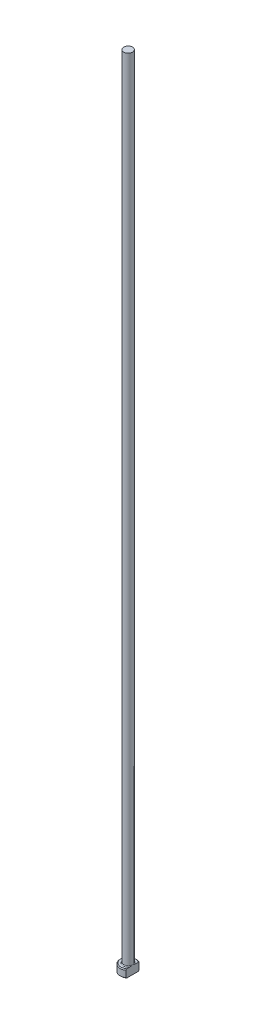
ISO-10303-21;
HEADER;
FILE_DESCRIPTION(('STEP AP214'),'2;1');
FILE_NAME('part.step','',(''),(''),'','','');
FILE_SCHEMA(('AUTOMOTIVE_DESIGN { 1 0 10303 214 1 1 1 1 }'));
ENDSEC;
DATA;
#1=APPLICATION_CONTEXT('core data for automotive mechanical design processes');
#2=APPLICATION_PROTOCOL_DEFINITION('international standard','automotive_design',2000,#1);
#3=PRODUCT_CONTEXT('',#1,'mechanical');
#4=PRODUCT('Part','Part','',(#3));
#5=PRODUCT_RELATED_PRODUCT_CATEGORY('part','',(#4));
#6=PRODUCT_DEFINITION_FORMATION('','',#4);
#7=PRODUCT_DEFINITION_CONTEXT('part definition',#1,'design');
#8=PRODUCT_DEFINITION('design','',#6,#7);
#9=PRODUCT_DEFINITION_SHAPE('','',#8);
#10=(LENGTH_UNIT() NAMED_UNIT(*) SI_UNIT(.MILLI.,.METRE.));
#11=(NAMED_UNIT(*) PLANE_ANGLE_UNIT() SI_UNIT($,.RADIAN.));
#12=(NAMED_UNIT(*) SI_UNIT($,.STERADIAN.) SOLID_ANGLE_UNIT());
#13=UNCERTAINTY_MEASURE_WITH_UNIT(LENGTH_MEASURE(1.E-05),#10,'distance_accuracy_value','');
#14=(GEOMETRIC_REPRESENTATION_CONTEXT(3) GLOBAL_UNCERTAINTY_ASSIGNED_CONTEXT((#13)) GLOBAL_UNIT_ASSIGNED_CONTEXT((#10,
#11,#12)) REPRESENTATION_CONTEXT('',''));
#15=CARTESIAN_POINT('',(0.,0.,0.));
#16=DIRECTION('',(0.,0.,1.));
#17=DIRECTION('',(1.,0.,0.));
#18=AXIS2_PLACEMENT_3D('',#15,#16,#17);
#19=CARTESIAN_POINT('',(0.,0.,0.));
#20=DIRECTION('',(0.,-1.,0.));
#21=DIRECTION('',(0.,0.,-1.));
#22=AXIS2_PLACEMENT_3D('',#19,#20,#21);
#23=PLANE('',#22);
#24=CARTESIAN_POINT('',(0.,0.,0.));
#25=DIRECTION('',(0.,-1.,0.));
#26=DIRECTION('',(0.,0.,-1.));
#27=AXIS2_PLACEMENT_3D('',#24,#25,#26);
#28=CIRCLE('',#27,1.8);
#29=CARTESIAN_POINT('',(1.09999999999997,0.,1.42478068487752));
#30=VERTEX_POINT('',#29);
#31=CARTESIAN_POINT('',(1.09999999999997,0.,-1.42478068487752));
#32=VERTEX_POINT('',#31);
#33=EDGE_CURVE('E98',#30,#32,#28,.T.);
#34=ORIENTED_EDGE('',*,*,#33,.T.);
#35=DIRECTION('',(0.,0.,1.));
#36=VECTOR('',#35,1.);
#37=CARTESIAN_POINT('',(1.09999999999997,0.,-1.67032930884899));
#38=LINE('',#37,#36);
#39=EDGE_CURVE('E83',#32,#30,#38,.T.);
#40=ORIENTED_EDGE('',*,*,#39,.T.);
#41=EDGE_LOOP('',(#34,#40));
#42=FACE_BOUND('',#41,.T.);
#43=ADVANCED_FACE('F32',(#42),#23,.T.);
#44=CARTESIAN_POINT('',(0.,259.958771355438,0.));
#45=DIRECTION('',(0.,1.,0.));
#46=DIRECTION('',(0.,0.,1.));
#47=AXIS2_PLACEMENT_3D('',#44,#45,#46);
#48=CYLINDRICAL_SURFACE('',#47,1.99999999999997);
#49=CARTESIAN_POINT('',(0.,1.80000000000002,0.));
#50=DIRECTION('',(0.,1.,0.));
#51=DIRECTION('',(0.,0.,1.));
#52=AXIS2_PLACEMENT_3D('',#49,#50,#51);
#53=CIRCLE('',#52,1.99999999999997);
#54=CARTESIAN_POINT('',(1.09999999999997,1.80000000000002,1.67032930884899));
#55=VERTEX_POINT('',#54);
#56=CARTESIAN_POINT('',(1.09999999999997,1.80000000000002,-1.67032930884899));
#57=VERTEX_POINT('',#56);
#58=EDGE_CURVE('E104',#55,#57,#53,.F.);
#59=ORIENTED_EDGE('',*,*,#58,.T.);
#60=DIRECTION('',(0.,-1.,0.));
#61=VECTOR('',#60,1.);
#62=CARTESIAN_POINT('',(1.09999999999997,200.,-1.67032930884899));
#63=LINE('',#62,#61);
#64=CARTESIAN_POINT('',(1.09999999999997,0.199999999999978,-1.67032930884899));
#65=VERTEX_POINT('',#64);
#66=EDGE_CURVE('E183',#57,#65,#63,.T.);
#67=ORIENTED_EDGE('',*,*,#66,.T.);
#68=CARTESIAN_POINT('',(0.,0.199999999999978,0.));
#69=DIRECTION('',(0.,-1.,0.));
#70=DIRECTION('',(0.,0.,-1.));
#71=AXIS2_PLACEMENT_3D('',#68,#69,#70);
#72=CIRCLE('',#71,1.99999999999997);
#73=CARTESIAN_POINT('',(1.09999999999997,0.199999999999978,1.67032930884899));
#74=VERTEX_POINT('',#73);
#75=EDGE_CURVE('E100',#65,#74,#72,.F.);
#76=ORIENTED_EDGE('',*,*,#75,.T.);
#77=DIRECTION('',(0.,-1.,0.));
#78=VECTOR('',#77,1.);
#79=CARTESIAN_POINT('',(1.09999999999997,200.,1.67032930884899));
#80=LINE('',#79,#78);
#81=EDGE_CURVE('E93',#55,#74,#80,.T.);
#82=ORIENTED_EDGE('',*,*,#81,.F.);
#83=EDGE_LOOP('',(#59,#67,#76,#82));
#84=FACE_BOUND('',#83,.T.);
#85=ADVANCED_FACE('F158',(#84),#48,.T.);
#86=CARTESIAN_POINT('',(-1.99999999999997,2.,0.));
#87=DIRECTION('',(0.,1.,0.));
#88=DIRECTION('',(0.,0.,1.));
#89=AXIS2_PLACEMENT_3D('',#86,#87,#88);
#90=PLANE('',#89);
#91=CARTESIAN_POINT('',(0.,2.,0.));
#92=DIRECTION('',(0.,1.,0.));
#93=DIRECTION('',(0.,0.,1.));
#94=AXIS2_PLACEMENT_3D('',#91,#92,#93);
#95=CIRCLE('',#94,1.8);
#96=CARTESIAN_POINT('',(1.09999999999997,2.,-1.42478068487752));
#97=VERTEX_POINT('',#96);
#98=CARTESIAN_POINT('',(1.09999999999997,2.,1.42478068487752));
#99=VERTEX_POINT('',#98);
#100=EDGE_CURVE('E178',#97,#99,#95,.T.);
#101=ORIENTED_EDGE('',*,*,#100,.T.);
#102=DIRECTION('',(0.,0.,-1.));
#103=VECTOR('',#102,1.);
#104=CARTESIAN_POINT('',(1.09999999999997,2.,0.));
#105=LINE('',#104,#103);
#106=CARTESIAN_POINT('',(1.09999999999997,1.99999999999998,0.692820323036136));
#107=VERTEX_POINT('',#106);
#108=EDGE_CURVE('E57',#99,#107,#105,.T.);
#109=ORIENTED_EDGE('',*,*,#108,.T.);
#110=CARTESIAN_POINT('',(0.,2.,0.));
#111=DIRECTION('',(0.,1.,0.));
#112=DIRECTION('',(0.,0.,1.));
#113=AXIS2_PLACEMENT_3D('',#110,#111,#112);
#114=CIRCLE('',#113,1.29999999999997);
#115=CARTESIAN_POINT('',(1.09999999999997,1.99999999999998,-0.692820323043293));
#116=VERTEX_POINT('',#115);
#117=EDGE_CURVE('E107',#107,#116,#114,.F.);
#118=ORIENTED_EDGE('',*,*,#117,.T.);
#119=EDGE_CURVE('E136',#116,#97,#105,.T.);
#120=ORIENTED_EDGE('',*,*,#119,.T.);
#121=EDGE_LOOP('',(#101,#109,#118,#120));
#122=FACE_BOUND('',#121,.T.);
#123=ADVANCED_FACE('F147',(#122),#90,.T.);
#124=CARTESIAN_POINT('',(0.,2.,0.));
#125=DIRECTION('',(0.,-1.,0.));
#126=DIRECTION('',(0.,0.,-1.));
#127=AXIS2_PLACEMENT_3D('',#124,#125,#126);
#128=CONICAL_SURFACE('',#127,1.8,0.785398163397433);
#129=ORIENTED_EDGE('',*,*,#58,.F.);
#130=CARTESIAN_POINT('',(1.09999999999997,-0.0394609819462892,3.67851337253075));
#131=CARTESIAN_POINT('',(1.09999999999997,0.0938871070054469,3.53927086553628));
#132=CARTESIAN_POINT('',(1.09999999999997,0.226969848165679,3.39976850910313));
#133=CARTESIAN_POINT('',(1.09999999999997,0.492235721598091,3.11984283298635));
#134=CARTESIAN_POINT('',(1.09999999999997,0.624418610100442,2.97941928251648));
#135=CARTESIAN_POINT('',(1.09999999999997,0.887405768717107,2.69736523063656));
#136=CARTESIAN_POINT('',(1.09999999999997,1.01821044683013,2.55573511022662));
#137=CARTESIAN_POINT('',(1.09999999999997,1.27771059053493,2.27057337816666));
#138=CARTESIAN_POINT('',(1.09999999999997,1.4064063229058,2.12704201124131));
#139=CARTESIAN_POINT('',(1.09999999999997,1.59274008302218,1.91391242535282));
#140=CARTESIAN_POINT('',(1.09999999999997,1.65179690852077,1.84555665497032));
#141=CARTESIAN_POINT('',(1.09999999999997,1.76883123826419,1.7079133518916));
#142=CARTESIAN_POINT('',(1.09999999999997,1.82680864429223,1.63862573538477));
#143=CARTESIAN_POINT('',(1.09999999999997,1.9413908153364,1.49868129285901));
#144=CARTESIAN_POINT('',(1.09999999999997,1.99799249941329,1.42802193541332));
#145=CARTESIAN_POINT('',(1.09999999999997,2.10905321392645,1.28504453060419));
#146=CARTESIAN_POINT('',(1.09999999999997,2.16351265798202,1.21272680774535));
#147=CARTESIAN_POINT('',(1.09999999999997,2.25351962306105,1.08760351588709));
#148=CARTESIAN_POINT('',(1.09999999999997,2.28987864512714,1.03538457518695));
#149=CARTESIAN_POINT('',(1.09999999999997,2.3604146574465,0.929499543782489));
#150=CARTESIAN_POINT('',(1.09999999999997,2.39459216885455,0.875833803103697));
#151=CARTESIAN_POINT('',(1.09999999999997,2.45984644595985,0.766757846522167));
#152=CARTESIAN_POINT('',(1.09999999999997,2.4909289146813,0.711351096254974));
#153=CARTESIAN_POINT('',(1.09999999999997,2.54873716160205,0.598347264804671));
#154=CARTESIAN_POINT('',(1.09999999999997,2.57546692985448,0.5407522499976));
#155=CARTESIAN_POINT('',(1.09999999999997,2.62531671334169,0.416467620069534));
#156=CARTESIAN_POINT('',(1.09999999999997,2.64771917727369,0.349473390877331));
#157=CARTESIAN_POINT('',(1.09999999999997,2.67308404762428,0.247046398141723));
#158=CARTESIAN_POINT('',(1.09999999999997,2.6801620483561,0.212626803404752));
#159=CARTESIAN_POINT('',(1.09999999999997,2.69123178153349,0.143302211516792));
#160=CARTESIAN_POINT('',(1.09999999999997,2.69522514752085,0.108397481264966));
#161=CARTESIAN_POINT('',(1.09999999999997,2.69990666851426,0.0380394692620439));
#162=CARTESIAN_POINT('',(1.09999999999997,2.70056409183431,0.00258409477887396));
#163=CARTESIAN_POINT('',(1.09999999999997,2.69845711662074,-0.0682167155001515));
#164=CARTESIAN_POINT('',(1.09999999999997,2.69569269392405,-0.103562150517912));
#165=CARTESIAN_POINT('',(1.09999999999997,2.68246916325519,-0.209100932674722));
#166=CARTESIAN_POINT('',(1.09999999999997,2.66707429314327,-0.278705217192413));
#167=CARTESIAN_POINT('',(1.09999999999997,2.63112909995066,-0.39840983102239));
#168=CARTESIAN_POINT('',(1.09999999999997,2.61268926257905,-0.449196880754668));
#169=CARTESIAN_POINT('',(1.09999999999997,2.57144771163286,-0.548998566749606));
#170=CARTESIAN_POINT('',(1.09999999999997,2.54864260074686,-0.598011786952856));
#171=CARTESIAN_POINT('',(1.09999999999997,2.49970814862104,-0.69462659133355));
#172=CARTESIAN_POINT('',(1.09999999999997,2.47356275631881,-0.742219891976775));
#173=CARTESIAN_POINT('',(1.09999999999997,2.41890398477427,-0.835986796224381));
#174=CARTESIAN_POINT('',(1.09999999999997,2.39039158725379,-0.882160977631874));
#175=CARTESIAN_POINT('',(1.09999999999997,2.32625511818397,-0.981643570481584));
#176=CARTESIAN_POINT('',(1.09999999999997,2.29028006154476,-1.03472421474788));
#177=CARTESIAN_POINT('',(1.09999999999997,2.21653305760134,-1.13962743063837));
#178=CARTESIAN_POINT('',(1.09999999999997,2.17876074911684,-1.19144974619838));
#179=CARTESIAN_POINT('',(1.09999999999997,2.06341857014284,-1.34551007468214));
#180=CARTESIAN_POINT('',(1.09999999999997,1.98387469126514,-1.44626517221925));
#181=CARTESIAN_POINT('',(1.09999999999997,1.8215284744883,-1.64549240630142));
#182=CARTESIAN_POINT('',(1.09999999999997,1.73871851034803,-1.74395822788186));
#183=CARTESIAN_POINT('',(1.09999999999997,1.571150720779,-1.93914128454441));
#184=CARTESIAN_POINT('',(1.09999999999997,1.48639373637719,-2.03585924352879));
#185=CARTESIAN_POINT('',(1.09999999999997,1.31545903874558,-2.2282018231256));
#186=CARTESIAN_POINT('',(1.09999999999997,1.22927997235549,-2.32382523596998));
#187=CARTESIAN_POINT('',(1.09999999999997,1.0559632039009,-2.51421569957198));
#188=CARTESIAN_POINT('',(1.09999999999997,0.96882540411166,-2.60898266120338));
#189=CARTESIAN_POINT('',(1.09999999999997,0.706597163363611,-2.89210208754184));
#190=CARTESIAN_POINT('',(1.09999999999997,0.530482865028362,-3.07950542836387));
#191=CARTESIAN_POINT('',(1.09999999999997,0.288219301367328,-3.33512571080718));
#192=CARTESIAN_POINT('',(1.09999999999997,0.222748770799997,-3.40399021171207));
#193=CARTESIAN_POINT('',(1.09999999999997,0.0917246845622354,-3.5414325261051));
#194=CARTESIAN_POINT('',(1.09999999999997,0.0261714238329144,-3.61001062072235));
#195=CARTESIAN_POINT('',(1.09999999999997,-0.0394609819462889,-3.67851337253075));
#196=B_SPLINE_CURVE_WITH_KNOTS('',3,(#130,#131,#132,#133,#134,#135,#136,#137,#138,#139,#140,
#141,#142,#143,#144,#145,#146,#147,#148,#149,#150,#151,#152,#153,#154,#155,#156,#157,#158,#159,
#160,#161,#162,#163,#164,#165,#166,#167,#168,#169,#170,#171,#172,#173,#174,#175,#176,#177,#178,
#179,#180,#181,#182,#183,#184,#185,#186,#187,#188,#189,#190,#191,#192,#193,#194,#195),
.UNSPECIFIED.,.F.,.F.,(4,2,2,2,2,2,2,2,2,2,2,2,2,2,2,2,2,2,2,2,2,2,2,2,2,2,2,2,2,2,2,2,4),(0.,
0.57839340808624,1.15693772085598,1.73530565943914,2.31359986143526,2.58459381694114,
2.85561231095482,3.12719032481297,3.39871564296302,3.58956709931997,3.78037278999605,
3.97082012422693,4.1610918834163,4.37223430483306,4.47753596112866,4.58278181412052,
4.68899548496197,4.79520990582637,5.00790932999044,5.16979123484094,5.33179964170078,
5.49461809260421,5.65736934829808,5.84968611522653,6.04204169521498,6.42702818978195,
6.81297408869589,7.19875629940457,7.58492959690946,7.97114262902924,8.74263124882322,
9.02768991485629,9.3122978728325),.UNSPECIFIED.);
#197=EDGE_CURVE('E135',#55,#99,#196,.T.);
#198=ORIENTED_EDGE('',*,*,#197,.T.);
#199=ORIENTED_EDGE('',*,*,#100,.F.);
#200=EDGE_CURVE('E127',#97,#57,#196,.T.);
#201=ORIENTED_EDGE('',*,*,#200,.T.);
#202=EDGE_LOOP('',(#129,#198,#199,#201));
#203=FACE_BOUND('',#202,.T.);
#204=ADVANCED_FACE('F143',(#203),#128,.T.);
#205=CARTESIAN_POINT('',(0.,0.199999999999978,0.));
#206=DIRECTION('',(0.,1.,0.));
#207=DIRECTION('',(0.,0.,1.));
#208=AXIS2_PLACEMENT_3D('',#205,#206,#207);
#209=CONICAL_SURFACE('',#208,1.99999999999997,0.785398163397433);
#210=ORIENTED_EDGE('',*,*,#75,.F.);
#211=CARTESIAN_POINT('',(1.09999999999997,2.03946098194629,-3.67851337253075));
#212=CARTESIAN_POINT('',(1.09999999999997,1.90611289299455,-3.53927086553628));
#213=CARTESIAN_POINT('',(1.09999999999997,1.77303015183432,-3.39976850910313));
#214=CARTESIAN_POINT('',(1.09999999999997,1.50776427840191,-3.11984283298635));
#215=CARTESIAN_POINT('',(1.09999999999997,1.37558138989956,-2.97941928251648));
#216=CARTESIAN_POINT('',(1.09999999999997,1.11259423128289,-2.69736523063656));
#217=CARTESIAN_POINT('',(1.09999999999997,0.981789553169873,-2.55573511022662));
#218=CARTESIAN_POINT('',(1.09999999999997,0.722289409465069,-2.27057337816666));
#219=CARTESIAN_POINT('',(1.09999999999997,0.593593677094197,-2.12704201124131));
#220=CARTESIAN_POINT('',(1.09999999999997,0.407259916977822,-1.91391242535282));
#221=CARTESIAN_POINT('',(1.09999999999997,0.348203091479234,-1.84555665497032));
#222=CARTESIAN_POINT('',(1.09999999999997,0.231168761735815,-1.7079133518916));
#223=CARTESIAN_POINT('',(1.09999999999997,0.173191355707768,-1.63862573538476));
#224=CARTESIAN_POINT('',(1.09999999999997,0.0586091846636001,-1.49868129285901));
#225=CARTESIAN_POINT('',(1.09999999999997,0.00200750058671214,-1.42802193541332));
#226=CARTESIAN_POINT('',(1.09999999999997,-0.109053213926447,-1.28504453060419));
#227=CARTESIAN_POINT('',(1.09999999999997,-0.16351265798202,-1.21272680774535));
#228=CARTESIAN_POINT('',(1.09999999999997,-0.253519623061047,-1.08760351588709));
#229=CARTESIAN_POINT('',(1.09999999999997,-0.289878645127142,-1.03538457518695));
#230=CARTESIAN_POINT('',(1.09999999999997,-0.3604146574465,-0.929499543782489));
#231=CARTESIAN_POINT('',(1.09999999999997,-0.394592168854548,-0.875833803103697));
#232=CARTESIAN_POINT('',(1.09999999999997,-0.459846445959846,-0.766757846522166));
#233=CARTESIAN_POINT('',(1.09999999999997,-0.490928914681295,-0.711351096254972));
#234=CARTESIAN_POINT('',(1.09999999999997,-0.548737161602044,-0.598347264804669));
#235=CARTESIAN_POINT('',(1.09999999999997,-0.575466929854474,-0.540752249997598));
#236=CARTESIAN_POINT('',(1.09999999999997,-0.625316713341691,-0.416467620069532));
#237=CARTESIAN_POINT('',(1.09999999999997,-0.647719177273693,-0.349473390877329));
#238=CARTESIAN_POINT('',(1.09999999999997,-0.67308404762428,-0.247046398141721));
#239=CARTESIAN_POINT('',(1.09999999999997,-0.680162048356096,-0.21262680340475));
#240=CARTESIAN_POINT('',(1.09999999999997,-0.691231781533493,-0.14330221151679));
#241=CARTESIAN_POINT('',(1.09999999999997,-0.695225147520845,-0.108397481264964));
#242=CARTESIAN_POINT('',(1.09999999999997,-0.699906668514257,-0.0380394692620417));
#243=CARTESIAN_POINT('',(1.09999999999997,-0.700564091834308,-0.00258409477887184));
#244=CARTESIAN_POINT('',(1.09999999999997,-0.698457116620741,0.0682167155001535));
#245=CARTESIAN_POINT('',(1.09999999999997,-0.695692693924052,0.103562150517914));
#246=CARTESIAN_POINT('',(1.09999999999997,-0.682469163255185,0.209100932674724));
#247=CARTESIAN_POINT('',(1.09999999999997,-0.667074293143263,0.278705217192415));
#248=CARTESIAN_POINT('',(1.09999999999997,-0.631129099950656,0.398409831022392));
#249=CARTESIAN_POINT('',(1.09999999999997,-0.612689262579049,0.449196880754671));
#250=CARTESIAN_POINT('',(1.09999999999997,-0.571447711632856,0.548998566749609));
#251=CARTESIAN_POINT('',(1.09999999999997,-0.548642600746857,0.598011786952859));
#252=CARTESIAN_POINT('',(1.09999999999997,-0.499708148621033,0.694626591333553));
#253=CARTESIAN_POINT('',(1.09999999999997,-0.47356275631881,0.742219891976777));
#254=CARTESIAN_POINT('',(1.09999999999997,-0.418903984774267,0.835986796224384));
#255=CARTESIAN_POINT('',(1.09999999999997,-0.390391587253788,0.882160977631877));
#256=CARTESIAN_POINT('',(1.09999999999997,-0.32625511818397,0.981643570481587));
#257=CARTESIAN_POINT('',(1.09999999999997,-0.290280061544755,1.03472421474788));
#258=CARTESIAN_POINT('',(1.09999999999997,-0.216533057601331,1.13962743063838));
#259=CARTESIAN_POINT('',(1.09999999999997,-0.178760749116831,1.19144974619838));
#260=CARTESIAN_POINT('',(1.09999999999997,-0.0634185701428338,1.34551007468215));
#261=CARTESIAN_POINT('',(1.09999999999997,0.0161253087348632,1.44626517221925));
#262=CARTESIAN_POINT('',(1.09999999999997,0.178471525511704,1.64549240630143));
#263=CARTESIAN_POINT('',(1.09999999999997,0.261281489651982,1.74395822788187));
#264=CARTESIAN_POINT('',(1.09999999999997,0.428849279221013,1.93914128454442));
#265=CARTESIAN_POINT('',(1.09999999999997,0.513606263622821,2.0358592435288));
#266=CARTESIAN_POINT('',(1.09999999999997,0.684540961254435,2.22820182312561));
#267=CARTESIAN_POINT('',(1.09999999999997,0.770720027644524,2.32382523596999));
#268=CARTESIAN_POINT('',(1.09999999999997,0.944036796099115,2.514215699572));
#269=CARTESIAN_POINT('',(1.09999999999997,1.03117459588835,2.60898266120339));
#270=CARTESIAN_POINT('',(1.09999999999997,1.2934028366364,2.89210208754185));
#271=CARTESIAN_POINT('',(1.09999999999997,1.46951713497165,3.07950542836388));
#272=CARTESIAN_POINT('',(1.09999999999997,1.71178069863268,3.33512571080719));
#273=CARTESIAN_POINT('',(1.09999999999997,1.77725122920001,3.40399021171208));
#274=CARTESIAN_POINT('',(1.09999999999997,1.90827531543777,3.5414325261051));
#275=CARTESIAN_POINT('',(1.09999999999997,1.97382857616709,3.61001062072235));
#276=CARTESIAN_POINT('',(1.09999999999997,2.03946098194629,3.67851337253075));
#277=B_SPLINE_CURVE_WITH_KNOTS('',3,(#211,#212,#213,#214,#215,#216,#217,#218,#219,#220,#221,
#222,#223,#224,#225,#226,#227,#228,#229,#230,#231,#232,#233,#234,#235,#236,#237,#238,#239,#240,
#241,#242,#243,#244,#245,#246,#247,#248,#249,#250,#251,#252,#253,#254,#255,#256,#257,#258,#259,
#260,#261,#262,#263,#264,#265,#266,#267,#268,#269,#270,#271,#272,#273,#274,#275,#276),
.UNSPECIFIED.,.F.,.F.,(4,2,2,2,2,2,2,2,2,2,2,2,2,2,2,2,2,2,2,2,2,2,2,2,2,2,2,2,2,2,2,2,4),(0.,
0.57839340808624,1.15693772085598,1.73530565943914,2.31359986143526,2.58459381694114,
2.85561231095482,3.12719032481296,3.39871564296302,3.58956709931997,3.78037278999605,
3.97082012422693,4.1610918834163,4.37223430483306,4.47753596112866,4.58278181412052,
4.68899548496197,4.79520990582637,5.00790932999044,5.16979123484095,5.33179964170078,
5.49461809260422,5.65736934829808,5.84968611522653,6.04204169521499,6.42702818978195,
6.8129740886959,7.19875629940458,7.58492959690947,7.97114262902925,8.74263124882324,
9.0276899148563,9.3122978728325),.UNSPECIFIED.);
#278=EDGE_CURVE('E86',#65,#32,#277,.T.);
#279=ORIENTED_EDGE('',*,*,#278,.T.);
#280=ORIENTED_EDGE('',*,*,#33,.F.);
#281=EDGE_CURVE('E89',#30,#74,#277,.T.);
#282=ORIENTED_EDGE('',*,*,#281,.T.);
#283=EDGE_LOOP('',(#210,#279,#280,#282));
#284=FACE_BOUND('',#283,.T.);
#285=ADVANCED_FACE('F97',(#284),#209,.T.);
#286=CARTESIAN_POINT('',(0.,2.19999999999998,0.));
#287=DIRECTION('',(0.,1.,0.));
#288=DIRECTION('',(0.,0.,1.));
#289=AXIS2_PLACEMENT_3D('',#286,#287,#288);
#290=TOROIDAL_SURFACE('',#289,1.29999999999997,0.2);
#291=CARTESIAN_POINT('',(1.09999999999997,2.19999999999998,0.));
#292=CARTESIAN_POINT('',(1.09999999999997,2.20000051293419,3.6073967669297E-11));
#293=CARTESIAN_POINT('',(1.09999999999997,2.20000102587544,-9.99111383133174E-08));
#294=CARTESIAN_POINT('',(1.09999999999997,2.20000201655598,-4.21307805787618E-07));
#295=CARTESIAN_POINT('',(1.09999999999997,2.20000249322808,-6.45471450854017E-07));
#296=CARTESIAN_POINT('',(1.09999999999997,2.20000344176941,-1.18549609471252E-06));
#297=CARTESIAN_POINT('',(1.09999999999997,2.20000391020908,-1.50725452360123E-06));
#298=CARTESIAN_POINT('',(1.09999999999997,2.20000479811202,-2.20431303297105E-06));
#299=CARTESIAN_POINT('',(1.09999999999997,2.20000521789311,-2.5792253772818E-06));
#300=CARTESIAN_POINT('',(1.09999999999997,2.2000066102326,-3.91337800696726E-06));
#301=CARTESIAN_POINT('',(1.09999999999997,2.20000751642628,-4.94273423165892E-06));
#302=CARTESIAN_POINT('',(1.09999999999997,2.20000914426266,-7.08045055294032E-06));
#303=CARTESIAN_POINT('',(1.09999999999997,2.20000987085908,-8.18525581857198E-06));
#304=CARTESIAN_POINT('',(1.09999999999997,2.20001256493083,-1.24548986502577E-05));
#305=CARTESIAN_POINT('',(1.09999999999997,2.20001438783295,-1.57147536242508E-05));
#306=CARTESIAN_POINT('',(1.09999999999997,2.20001740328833,-2.21764542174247E-05));
#307=CARTESIAN_POINT('',(1.09999999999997,2.20001863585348,-2.53602841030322E-05));
#308=CARTESIAN_POINT('',(1.09999999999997,2.20002381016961,-3.88057522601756E-05));
#309=CARTESIAN_POINT('',(1.09999999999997,2.20002769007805,-4.90846952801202E-05));
#310=CARTESIAN_POINT('',(1.09999999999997,2.20003398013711,-6.83950902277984E-05));
#311=CARTESIAN_POINT('',(1.09999999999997,2.2000365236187,-7.73813874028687E-05));
#312=CARTESIAN_POINT('',(1.09999999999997,2.20005650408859,-0.000142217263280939));
#313=CARTESIAN_POINT('',(1.09999999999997,2.2000817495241,-0.000195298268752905));
#314=CARTESIAN_POINT('',(1.09999999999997,2.20017599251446,-0.00040106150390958));
#315=CARTESIAN_POINT('',(1.09999999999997,2.20023918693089,-0.000555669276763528));
#316=CARTESIAN_POINT('',(1.09999999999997,2.20048725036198,-0.00115356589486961));
#317=CARTESIAN_POINT('',(1.09999999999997,2.20067820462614,-0.00159487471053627));
#318=CARTESIAN_POINT('',(1.09999999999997,2.20145114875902,-0.00338993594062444));
#319=CARTESIAN_POINT('',(1.09999999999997,2.20202628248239,-0.00474587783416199));
#320=CARTESIAN_POINT('',(1.09999999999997,2.20972642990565,-0.0228890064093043));
#321=CARTESIAN_POINT('',(1.09999999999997,2.21689763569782,-0.0396618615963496));
#322=CARTESIAN_POINT('',(1.09999999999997,2.23088776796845,-0.0726432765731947));
#323=CARTESIAN_POINT('',(1.09999999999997,2.23771010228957,-0.0888504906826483));
#324=CARTESIAN_POINT('',(1.09999999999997,2.2520105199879,-0.12316170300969));
#325=CARTESIAN_POINT('',(1.09999999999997,2.25947482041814,-0.141271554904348));
#326=CARTESIAN_POINT('',(1.09999999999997,2.27424285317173,-0.177765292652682));
#327=CARTESIAN_POINT('',(1.09999999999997,2.28154426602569,-0.196150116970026));
#328=CARTESIAN_POINT('',(1.09999999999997,2.29932484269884,-0.242089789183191));
#329=CARTESIAN_POINT('',(1.09999999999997,2.30960714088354,-0.269721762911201));
#330=CARTESIAN_POINT('',(1.09999999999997,2.32891385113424,-0.324725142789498));
#331=CARTESIAN_POINT('',(1.09999999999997,2.33796145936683,-0.352088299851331));
#332=CARTESIAN_POINT('',(1.09999999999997,2.35364474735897,-0.40369058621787));
#333=CARTESIAN_POINT('',(1.09999999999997,2.36044093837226,-0.427880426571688));
#334=CARTESIAN_POINT('',(1.09999999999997,2.37278398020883,-0.47674569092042));
#335=CARTESIAN_POINT('',(1.09999999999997,2.37832261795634,-0.501423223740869));
#336=CARTESIAN_POINT('',(1.09999999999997,2.38801040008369,-0.552403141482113));
#337=CARTESIAN_POINT('',(1.09999999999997,2.39207120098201,-0.578722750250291));
#338=CARTESIAN_POINT('',(1.09999999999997,2.39789224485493,-0.631611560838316));
#339=CARTESIAN_POINT('',(1.09999999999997,2.39965448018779,-0.658180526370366));
#340=CARTESIAN_POINT('',(1.09999999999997,2.40018565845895,-0.705278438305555));
#341=CARTESIAN_POINT('',(1.09999999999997,2.39954710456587,-0.725798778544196));
#342=CARTESIAN_POINT('',(1.09999999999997,2.39616992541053,-0.766506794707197));
#343=CARTESIAN_POINT('',(1.09999999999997,2.39344923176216,-0.786695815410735));
#344=CARTESIAN_POINT('',(1.09999999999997,2.38541819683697,-0.826869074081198));
#345=CARTESIAN_POINT('',(1.09999999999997,2.38007173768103,-0.846846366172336));
#346=CARTESIAN_POINT('',(1.09999999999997,2.36615936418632,-0.885705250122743));
#347=CARTESIAN_POINT('',(1.09999999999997,2.35759666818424,-0.904587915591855));
#348=CARTESIAN_POINT('',(1.09999999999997,2.3413093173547,-0.932102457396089));
#349=CARTESIAN_POINT('',(1.09999999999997,2.33493263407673,-0.94153212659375));
#350=CARTESIAN_POINT('',(1.09999999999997,2.32089802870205,-0.959389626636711));
#351=CARTESIAN_POINT('',(1.09999999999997,2.31324176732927,-0.967818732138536));
#352=CARTESIAN_POINT('',(1.09999999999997,2.29794985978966,-0.982021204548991));
#353=CARTESIAN_POINT('',(1.09999999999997,2.2905098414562,-0.988003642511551));
#354=CARTESIAN_POINT('',(1.09999999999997,2.27474667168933,-0.998671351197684));
#355=CARTESIAN_POINT('',(1.09999999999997,2.26642452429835,-1.00335807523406));
#356=CARTESIAN_POINT('',(1.09999999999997,2.25045003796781,-1.01049114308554));
#357=CARTESIAN_POINT('',(1.09999999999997,2.24290483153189,-1.01317643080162));
#358=CARTESIAN_POINT('',(1.09999999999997,2.22746947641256,-1.01724295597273));
#359=CARTESIAN_POINT('',(1.09999999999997,2.21957951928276,-1.01862490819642));
#360=CARTESIAN_POINT('',(1.09999999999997,2.20365797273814,-1.0199891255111));
#361=CARTESIAN_POINT('',(1.09999999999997,2.19562607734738,-1.01996786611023));
#362=CARTESIAN_POINT('',(1.09999999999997,2.17969084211,-1.01851853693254));
#363=CARTESIAN_POINT('',(1.09999999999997,2.1717875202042,-1.01709027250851));
#364=CARTESIAN_POINT('',(1.09999999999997,2.15661212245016,-1.01300324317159));
#365=CARTESIAN_POINT('',(1.09999999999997,2.14932759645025,-1.01038998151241));
#366=CARTESIAN_POINT('',(1.09999999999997,2.13523656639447,-1.00410166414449));
#367=CARTESIAN_POINT('',(1.09999999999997,2.12843022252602,-1.00042625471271));
#368=CARTESIAN_POINT('',(1.09999999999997,2.11281201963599,-0.990557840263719));
#369=CARTESIAN_POINT('',(1.09999999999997,2.10426616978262,-0.983943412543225));
#370=CARTESIAN_POINT('',(1.09999999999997,2.08835473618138,-0.969418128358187));
#371=CARTESIAN_POINT('',(1.09999999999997,2.08099195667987,-0.961504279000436));
#372=CARTESIAN_POINT('',(1.09999999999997,2.06451454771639,-0.941147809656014));
#373=CARTESIAN_POINT('',(1.09999999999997,2.05600335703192,-0.928218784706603));
#374=CARTESIAN_POINT('',(1.09999999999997,2.04111601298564,-0.901229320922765));
#375=CARTESIAN_POINT('',(1.09999999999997,2.03473990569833,-0.887168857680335));
#376=CARTESIAN_POINT('',(1.09999999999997,2.0205978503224,-0.849888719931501));
#377=CARTESIAN_POINT('',(1.09999999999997,2.01422029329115,-0.826146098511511));
#378=CARTESIAN_POINT('',(1.09999999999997,2.0050305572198,-0.777766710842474));
#379=CARTESIAN_POINT('',(1.09999999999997,2.00226155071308,-0.753122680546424));
#380=CARTESIAN_POINT('',(1.09999999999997,1.99848820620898,-0.682856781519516));
#381=CARTESIAN_POINT('',(1.09999999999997,2.00093637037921,-0.637054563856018));
#382=CARTESIAN_POINT('',(1.09999999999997,2.0092928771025,-0.570140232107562));
#383=CARTESIAN_POINT('',(1.09999999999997,2.01272884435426,-0.548616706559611));
#384=CARTESIAN_POINT('',(1.09999999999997,2.02080692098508,-0.505905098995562));
#385=CARTESIAN_POINT('',(1.09999999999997,2.0254425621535,-0.484715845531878));
#386=CARTESIAN_POINT('',(1.09999999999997,2.03889892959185,-0.42948239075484));
#387=CARTESIAN_POINT('',(1.09999999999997,2.04852945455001,-0.395639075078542));
#388=CARTESIAN_POINT('',(1.09999999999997,2.06989966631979,-0.327791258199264));
#389=CARTESIAN_POINT('',(1.09999999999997,2.08168242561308,-0.293800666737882));
#390=CARTESIAN_POINT('',(1.09999999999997,2.10244380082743,-0.237493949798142));
#391=CARTESIAN_POINT('',(1.09999999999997,2.11105810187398,-0.21504099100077));
#392=CARTESIAN_POINT('',(1.09999999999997,2.12862794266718,-0.170525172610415));
#393=CARTESIAN_POINT('',(1.09999999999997,2.13757927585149,-0.14846064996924));
#394=CARTESIAN_POINT('',(1.09999999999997,2.15480867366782,-0.106697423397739));
#395=CARTESIAN_POINT('',(1.09999999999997,2.16306162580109,-0.0869881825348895));
#396=CARTESIAN_POINT('',(1.09999999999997,2.18002424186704,-0.0468908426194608));
#397=CARTESIAN_POINT('',(1.09999999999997,2.18873943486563,-0.0265049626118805));
#398=CARTESIAN_POINT('',(1.09999999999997,2.19797392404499,-0.00474531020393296));
#399=CARTESIAN_POINT('',(1.09999999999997,2.19854931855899,-0.00338881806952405));
#400=CARTESIAN_POINT('',(1.09999999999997,2.1993223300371,-0.00159362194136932));
#401=CARTESIAN_POINT('',(1.09999999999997,2.19951310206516,-0.00115273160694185));
#402=CARTESIAN_POINT('',(1.09999999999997,2.19976094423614,-0.000555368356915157));
#403=CARTESIAN_POINT('',(1.09999999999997,2.19982409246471,-0.000400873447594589));
#404=CARTESIAN_POINT('',(1.09999999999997,2.19991827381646,-0.000195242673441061));
#405=CARTESIAN_POINT('',(1.09999999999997,2.19994350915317,-0.000142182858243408));
#406=CARTESIAN_POINT('',(1.09999999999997,2.19996348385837,-7.73713511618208E-05));
#407=CARTESIAN_POINT('',(1.09999999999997,2.19996602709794,-6.83867125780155E-05));
#408=CARTESIAN_POINT('',(1.09999999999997,2.19997231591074,-4.90799325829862E-05));
#409=CARTESIAN_POINT('',(1.09999999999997,2.19997619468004,-3.88029010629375E-05));
#410=CARTESIAN_POINT('',(1.09999999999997,2.19998136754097,-2.53595805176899E-05));
#411=CARTESIAN_POINT('',(1.09999999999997,2.19998259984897,-2.21760163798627E-05));
#412=CARTESIAN_POINT('',(1.09999999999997,2.19998561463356,-1.57148108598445E-05));
#413=CARTESIAN_POINT('',(1.09999999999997,2.19998743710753,-1.24551761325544E-05));
#414=CARTESIAN_POINT('',(1.09999999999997,2.19999013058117,-8.18573740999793E-06));
#415=CARTESIAN_POINT('',(1.09999999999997,2.19999085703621,-7.08095311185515E-06));
#416=CARTESIAN_POINT('',(1.09999999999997,2.19999248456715,-4.94325032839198E-06));
#417=CARTESIAN_POINT('',(1.09999999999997,2.19999339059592,-3.9138854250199E-06));
#418=CARTESIAN_POINT('',(1.09999999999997,2.19999478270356,-2.57968679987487E-06));
#419=CARTESIAN_POINT('',(1.09999999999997,2.19999520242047,-2.2047544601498E-06));
#420=CARTESIAN_POINT('',(1.09999999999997,2.1999960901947,-1.50764450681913E-06));
#421=CARTESIAN_POINT('',(1.09999999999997,2.1999965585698,-1.18585452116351E-06));
#422=CARTESIAN_POINT('',(1.09999999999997,2.19999750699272,-6.45753424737E-07));
#423=CARTESIAN_POINT('',(1.09999999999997,2.1999979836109,-4.21546286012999E-07));
#424=CARTESIAN_POINT('',(1.09999999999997,2.19999897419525,-1.00044385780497E-07));
#425=CARTESIAN_POINT('',(1.09999999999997,2.1999994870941,-3.60719752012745E-11));
#426=CARTESIAN_POINT('',(1.09999999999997,2.19999999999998,0.));
#427=B_SPLINE_CURVE_WITH_KNOTS('',3,(#291,#292,#293,#294,#295,#296,#297,#298,#299,#300,#301,
#302,#303,#304,#305,#306,#307,#308,#309,#310,#311,#312,#313,#314,#315,#316,#317,#318,#319,#320,
#321,#322,#323,#324,#325,#326,#327,#328,#329,#330,#331,#332,#333,#334,#335,#336,#337,#338,#339,
#340,#341,#342,#343,#344,#345,#346,#347,#348,#349,#350,#351,#352,#353,#354,#355,#356,#357,#358,
#359,#360,#361,#362,#363,#364,#365,#366,#367,#368,#369,#370,#371,#372,#373,#374,#375,#376,#377,
#378,#379,#380,#381,#382,#383,#384,#385,#386,#387,#388,#389,#390,#391,#392,#393,#394,#395,#396,
#397,#398,#399,#400,#401,#402,#403,#404,#405,#406,#407,#408,#409,#410,#411,#412,#413,#414,#415,
#416,#417,#418,#419,#420,#421,#422,#423,#424,#425,#426),.UNSPECIFIED.,.T.,.F.,(4,2,2,2,2,2,2,2,
2,2,2,2,2,2,2,2,2,2,2,2,2,2,2,2,2,2,2,2,2,2,2,2,2,2,2,2,2,2,2,2,2,2,2,2,2,2,2,2,2,2,2,2,2,2,2,2,
2,2,2,2,2,2,2,2,2,2,2,4),(0.,1.53757781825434E-06,3.11015844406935E-06,4.80844102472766E-06,
6.49491820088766E-06,1.05889533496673E-05,1.4552753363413E-05,2.57199109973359E-05,
3.59516089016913E-05,6.89038245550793E-05,9.68952770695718E-05,0.000272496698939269,
0.000774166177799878,0.00221597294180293,0.00663537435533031,0.0613537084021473,
0.114108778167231,0.172870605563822,0.232213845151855,0.32064861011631,0.407082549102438,
0.482434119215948,0.558264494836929,0.638080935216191,0.717828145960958,0.779333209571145,
0.840314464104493,0.902159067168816,0.963941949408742,0.998002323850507,1.03201883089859,
1.06055188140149,1.08905279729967,1.1129756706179,1.136885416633,1.16085521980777,
1.18482833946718,1.20795004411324,1.23107945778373,1.26331905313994,1.29563397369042,
1.341811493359,1.38799000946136,1.46132993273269,1.53553947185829,1.67227413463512,
1.73765429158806,1.8026890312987,1.90816998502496,2.01605526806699,2.08819695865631,
2.15962670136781,2.22373012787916,2.29023422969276,2.2946554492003,2.29609588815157,
2.29659719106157,2.29677272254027,2.29680070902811,2.29683365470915,2.2968438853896,
2.29685505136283,2.29685901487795,2.29686310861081,2.29686479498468,2.2968664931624,
2.29686806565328,2.29686960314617),.UNSPECIFIED.);
#428=CARTESIAN_POINT('',(1.09999999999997,2.19999999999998,0.));
#429=VERTEX_POINT('',#428);
#430=EDGE_CURVE('E11',#116,#429,#427,.T.);
#431=ORIENTED_EDGE('',*,*,#430,.F.);
#432=ORIENTED_EDGE('',*,*,#117,.F.);
#433=CARTESIAN_POINT('',(1.09999999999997,2.19999999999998,0.));
#434=CARTESIAN_POINT('',(1.09999999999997,2.19999948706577,-3.60741074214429E-11));
#435=CARTESIAN_POINT('',(1.09999999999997,2.19999897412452,9.99111381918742E-08));
#436=CARTESIAN_POINT('',(1.09999999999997,2.19999798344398,4.21307805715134E-07));
#437=CARTESIAN_POINT('',(1.09999999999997,2.19999750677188,6.4547145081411E-07));
#438=CARTESIAN_POINT('',(1.09999999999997,2.19999655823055,1.18549609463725E-06));
#439=CARTESIAN_POINT('',(1.09999999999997,2.19999608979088,1.50725452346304E-06));
#440=CARTESIAN_POINT('',(1.09999999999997,2.19999520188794,2.20431303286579E-06));
#441=CARTESIAN_POINT('',(1.09999999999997,2.19999478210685,2.5792253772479E-06));
#442=CARTESIAN_POINT('',(1.09999999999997,2.19999338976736,3.91337800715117E-06));
#443=CARTESIAN_POINT('',(1.09999999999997,2.19999248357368,4.9427342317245E-06));
#444=CARTESIAN_POINT('',(1.09999999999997,2.1999908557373,7.08045055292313E-06));
#445=CARTESIAN_POINT('',(1.09999999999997,2.19999012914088,8.18525581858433E-06));
#446=CARTESIAN_POINT('',(1.09999999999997,2.19998743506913,1.2454898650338E-05));
#447=CARTESIAN_POINT('',(1.09999999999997,2.19998561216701,1.57147536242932E-05));
#448=CARTESIAN_POINT('',(1.09999999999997,2.19998259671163,2.21764542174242E-05));
#449=CARTESIAN_POINT('',(1.09999999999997,2.19998136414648,2.53602841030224E-05));
#450=CARTESIAN_POINT('',(1.09999999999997,2.19997618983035,3.88057522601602E-05));
#451=CARTESIAN_POINT('',(1.09999999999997,2.19997230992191,4.90846952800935E-05));
#452=CARTESIAN_POINT('',(1.09999999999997,2.19996601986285,6.83950902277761E-05));
#453=CARTESIAN_POINT('',(1.09999999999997,2.19996347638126,7.7381387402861E-05));
#454=CARTESIAN_POINT('',(1.09999999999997,2.19994349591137,0.000142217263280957));
#455=CARTESIAN_POINT('',(1.09999999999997,2.19991825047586,0.000195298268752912));
#456=CARTESIAN_POINT('',(1.09999999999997,2.1998240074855,0.000401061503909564));
#457=CARTESIAN_POINT('',(1.09999999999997,2.19976081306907,0.000555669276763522));
#458=CARTESIAN_POINT('',(1.09999999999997,2.19951274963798,0.00115356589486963));
#459=CARTESIAN_POINT('',(1.09999999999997,2.19932179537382,0.00159487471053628));
#460=CARTESIAN_POINT('',(1.09999999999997,2.19854885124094,0.00338993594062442));
#461=CARTESIAN_POINT('',(1.09999999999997,2.19797371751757,0.00474587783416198));
#462=CARTESIAN_POINT('',(1.09999999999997,2.19027357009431,0.0228890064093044));
#463=CARTESIAN_POINT('',(1.09999999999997,2.18310236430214,0.0396618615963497));
#464=CARTESIAN_POINT('',(1.09999999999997,2.16911223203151,0.0726432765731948));
#465=CARTESIAN_POINT('',(1.09999999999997,2.16228989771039,0.0888504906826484));
#466=CARTESIAN_POINT('',(1.09999999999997,2.14798948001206,0.12316170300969));
#467=CARTESIAN_POINT('',(1.09999999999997,2.14052517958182,0.141271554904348));
#468=CARTESIAN_POINT('',(1.09999999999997,2.12575714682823,0.177765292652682));
#469=CARTESIAN_POINT('',(1.09999999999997,2.11845573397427,0.196150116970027));
#470=CARTESIAN_POINT('',(1.09999999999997,2.10067515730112,0.242089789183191));
#471=CARTESIAN_POINT('',(1.09999999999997,2.09039285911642,0.269721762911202));
#472=CARTESIAN_POINT('',(1.09999999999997,2.07108614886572,0.324725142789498));
#473=CARTESIAN_POINT('',(1.09999999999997,2.06203854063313,0.352088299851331));
#474=CARTESIAN_POINT('',(1.09999999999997,2.04635525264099,0.40369058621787));
#475=CARTESIAN_POINT('',(1.09999999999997,2.0395590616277,0.427880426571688));
#476=CARTESIAN_POINT('',(1.09999999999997,2.02721601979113,0.47674569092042));
#477=CARTESIAN_POINT('',(1.09999999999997,2.02167738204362,0.50142322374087));
#478=CARTESIAN_POINT('',(1.09999999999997,2.01198959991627,0.552403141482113));
#479=CARTESIAN_POINT('',(1.09999999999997,2.00792879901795,0.578722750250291));
#480=CARTESIAN_POINT('',(1.09999999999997,2.00210775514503,0.631611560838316));
#481=CARTESIAN_POINT('',(1.09999999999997,2.00034551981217,0.658180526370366));
#482=CARTESIAN_POINT('',(1.09999999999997,1.99981434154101,0.705278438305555));
#483=CARTESIAN_POINT('',(1.09999999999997,2.00045289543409,0.725798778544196));
#484=CARTESIAN_POINT('',(1.09999999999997,2.00383007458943,0.766506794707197));
#485=CARTESIAN_POINT('',(1.09999999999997,2.0065507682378,0.786695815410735));
#486=CARTESIAN_POINT('',(1.09999999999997,2.01458180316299,0.826869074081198));
#487=CARTESIAN_POINT('',(1.09999999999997,2.01992826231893,0.846846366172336));
#488=CARTESIAN_POINT('',(1.09999999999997,2.03384063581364,0.885705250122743));
#489=CARTESIAN_POINT('',(1.09999999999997,2.04240333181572,0.904587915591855));
#490=CARTESIAN_POINT('',(1.09999999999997,2.05869068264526,0.932102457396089));
#491=CARTESIAN_POINT('',(1.09999999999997,2.06506736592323,0.94153212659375));
#492=CARTESIAN_POINT('',(1.09999999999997,2.07910197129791,0.959389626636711));
#493=CARTESIAN_POINT('',(1.09999999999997,2.08675823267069,0.967818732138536));
#494=CARTESIAN_POINT('',(1.09999999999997,2.1020501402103,0.982021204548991));
#495=CARTESIAN_POINT('',(1.09999999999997,2.10949015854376,0.988003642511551));
#496=CARTESIAN_POINT('',(1.09999999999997,2.12525332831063,0.998671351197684));
#497=CARTESIAN_POINT('',(1.09999999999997,2.13357547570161,1.00335807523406));
#498=CARTESIAN_POINT('',(1.09999999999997,2.14954996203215,1.01049114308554));
#499=CARTESIAN_POINT('',(1.09999999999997,2.15709516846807,1.01317643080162));
#500=CARTESIAN_POINT('',(1.09999999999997,2.1725305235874,1.01724295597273));
#501=CARTESIAN_POINT('',(1.09999999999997,2.1804204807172,1.01862490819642));
#502=CARTESIAN_POINT('',(1.09999999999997,2.19634202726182,1.0199891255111));
#503=CARTESIAN_POINT('',(1.09999999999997,2.20437392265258,1.01996786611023));
#504=CARTESIAN_POINT('',(1.09999999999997,2.22030915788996,1.01851853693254));
#505=CARTESIAN_POINT('',(1.09999999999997,2.22821247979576,1.01709027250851));
#506=CARTESIAN_POINT('',(1.09999999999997,2.2433878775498,1.01300324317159));
#507=CARTESIAN_POINT('',(1.09999999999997,2.25067240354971,1.01038998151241));
#508=CARTESIAN_POINT('',(1.09999999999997,2.26476343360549,1.00410166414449));
#509=CARTESIAN_POINT('',(1.09999999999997,2.27156977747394,1.00042625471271));
#510=CARTESIAN_POINT('',(1.09999999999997,2.28718798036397,0.990557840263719));
#511=CARTESIAN_POINT('',(1.09999999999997,2.29573383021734,0.983943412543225));
#512=CARTESIAN_POINT('',(1.09999999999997,2.31164526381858,0.969418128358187));
#513=CARTESIAN_POINT('',(1.09999999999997,2.31900804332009,0.961504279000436));
#514=CARTESIAN_POINT('',(1.09999999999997,2.33548545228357,0.941147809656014));
#515=CARTESIAN_POINT('',(1.09999999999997,2.34399664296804,0.928218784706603));
#516=CARTESIAN_POINT('',(1.09999999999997,2.35888398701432,0.901229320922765));
#517=CARTESIAN_POINT('',(1.09999999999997,2.36526009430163,0.887168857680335));
#518=CARTESIAN_POINT('',(1.09999999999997,2.37940214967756,0.849888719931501));
#519=CARTESIAN_POINT('',(1.09999999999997,2.38577970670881,0.826146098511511));
#520=CARTESIAN_POINT('',(1.09999999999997,2.39496944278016,0.777766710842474));
#521=CARTESIAN_POINT('',(1.09999999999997,2.39773844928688,0.753122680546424));
#522=CARTESIAN_POINT('',(1.09999999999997,2.40151179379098,0.682856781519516));
#523=CARTESIAN_POINT('',(1.09999999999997,2.39906362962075,0.637054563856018));
#524=CARTESIAN_POINT('',(1.09999999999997,2.39070712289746,0.570140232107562));
#525=CARTESIAN_POINT('',(1.09999999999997,2.3872711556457,0.548616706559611));
#526=CARTESIAN_POINT('',(1.09999999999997,2.37919307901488,0.505905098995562));
#527=CARTESIAN_POINT('',(1.09999999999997,2.37455743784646,0.484715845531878));
#528=CARTESIAN_POINT('',(1.09999999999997,2.36110107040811,0.42948239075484));
#529=CARTESIAN_POINT('',(1.09999999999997,2.35147054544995,0.395639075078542));
#530=CARTESIAN_POINT('',(1.09999999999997,2.33010033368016,0.327791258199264));
#531=CARTESIAN_POINT('',(1.09999999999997,2.31831757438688,0.293800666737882));
#532=CARTESIAN_POINT('',(1.09999999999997,2.29755619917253,0.237493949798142));
#533=CARTESIAN_POINT('',(1.09999999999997,2.28894189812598,0.21504099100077));
#534=CARTESIAN_POINT('',(1.09999999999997,2.27137205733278,0.170525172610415));
#535=CARTESIAN_POINT('',(1.09999999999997,2.26242072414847,0.148460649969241));
#536=CARTESIAN_POINT('',(1.09999999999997,2.24519132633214,0.106697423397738));
#537=CARTESIAN_POINT('',(1.09999999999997,2.23693837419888,0.086988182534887));
#538=CARTESIAN_POINT('',(1.09999999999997,2.21997575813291,0.0468908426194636));
#539=CARTESIAN_POINT('',(1.09999999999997,2.2112605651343,0.0265049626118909));
#540=CARTESIAN_POINT('',(1.09999999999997,2.20202607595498,0.00474531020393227));
#541=CARTESIAN_POINT('',(1.09999999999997,2.20145068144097,0.00338881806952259));
#542=CARTESIAN_POINT('',(1.09999999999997,2.20067766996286,0.0015936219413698));
#543=CARTESIAN_POINT('',(1.09999999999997,2.2004868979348,0.00115273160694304));
#544=CARTESIAN_POINT('',(1.09999999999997,2.20023905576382,0.000555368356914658));
#545=CARTESIAN_POINT('',(1.09999999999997,2.20017590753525,0.00040087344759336));
#546=CARTESIAN_POINT('',(1.09999999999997,2.2000817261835,0.000195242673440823));
#547=CARTESIAN_POINT('',(1.09999999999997,2.20005649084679,0.000142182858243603));
#548=CARTESIAN_POINT('',(1.09999999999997,2.20003651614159,7.73713511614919E-05));
#549=CARTESIAN_POINT('',(1.09999999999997,2.20003397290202,6.83867125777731E-05));
#550=CARTESIAN_POINT('',(1.09999999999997,2.20002768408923,4.90799325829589E-05));
#551=CARTESIAN_POINT('',(1.09999999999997,2.20002380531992,3.88029010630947E-05));
#552=CARTESIAN_POINT('',(1.09999999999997,2.20001863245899,2.53595805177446E-05));
#553=CARTESIAN_POINT('',(1.09999999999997,2.20001740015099,2.21760163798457E-05));
#554=CARTESIAN_POINT('',(1.09999999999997,2.2000143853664,1.57148108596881E-05));
#555=CARTESIAN_POINT('',(1.09999999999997,2.20001256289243,1.24551761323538E-05));
#556=CARTESIAN_POINT('',(1.09999999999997,2.20000986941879,8.18573740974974E-06));
#557=CARTESIAN_POINT('',(1.09999999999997,2.20000914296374,7.0809531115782E-06));
#558=CARTESIAN_POINT('',(1.09999999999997,2.20000751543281,4.94325032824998E-06));
#559=CARTESIAN_POINT('',(1.09999999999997,2.20000660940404,3.91388542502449E-06));
#560=CARTESIAN_POINT('',(1.09999999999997,2.2000052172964,2.57968680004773E-06));
#561=CARTESIAN_POINT('',(1.09999999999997,2.20000479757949,2.20475446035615E-06));
#562=CARTESIAN_POINT('',(1.09999999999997,2.20000390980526,1.50764450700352E-06));
#563=CARTESIAN_POINT('',(1.09999999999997,2.20000344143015,1.18585452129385E-06));
#564=CARTESIAN_POINT('',(1.09999999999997,2.20000249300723,6.45753424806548E-07));
#565=CARTESIAN_POINT('',(1.09999999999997,2.20000201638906,4.215462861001E-07));
#566=CARTESIAN_POINT('',(1.09999999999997,2.20000102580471,1.00044385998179E-07));
#567=CARTESIAN_POINT('',(1.09999999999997,2.20000051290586,3.60721149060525E-11));
#568=CARTESIAN_POINT('',(1.09999999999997,2.19999999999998,0.));
#569=B_SPLINE_CURVE_WITH_KNOTS('',3,(#433,#434,#435,#436,#437,#438,#439,#440,#441,#442,#443,
#444,#445,#446,#447,#448,#449,#450,#451,#452,#453,#454,#455,#456,#457,#458,#459,#460,#461,#462,
#463,#464,#465,#466,#467,#468,#469,#470,#471,#472,#473,#474,#475,#476,#477,#478,#479,#480,#481,
#482,#483,#484,#485,#486,#487,#488,#489,#490,#491,#492,#493,#494,#495,#496,#497,#498,#499,#500,
#501,#502,#503,#504,#505,#506,#507,#508,#509,#510,#511,#512,#513,#514,#515,#516,#517,#518,#519,
#520,#521,#522,#523,#524,#525,#526,#527,#528,#529,#530,#531,#532,#533,#534,#535,#536,#537,#538,
#539,#540,#541,#542,#543,#544,#545,#546,#547,#548,#549,#550,#551,#552,#553,#554,#555,#556,#557,
#558,#559,#560,#561,#562,#563,#564,#565,#566,#567,#568),.UNSPECIFIED.,.T.,.F.,(4,2,2,2,2,2,2,2,
2,2,2,2,2,2,2,2,2,2,2,2,2,2,2,2,2,2,2,2,2,2,2,2,2,2,2,2,2,2,2,2,2,2,2,2,2,2,2,2,2,2,2,2,2,2,2,2,
2,2,2,2,2,2,2,2,2,2,2,4),(0.,1.53757781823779E-06,3.11015844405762E-06,4.80844102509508E-06,
6.49491820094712E-06,1.05889533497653E-05,1.45527533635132E-05,2.57199109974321E-05,
3.59516089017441E-05,6.89038245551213E-05,9.68952770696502E-05,0.000272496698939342,
0.000774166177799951,0.002215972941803,0.00663537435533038,0.0613537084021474,0.114108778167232,
0.172870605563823,0.232213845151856,0.320648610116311,0.407082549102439,0.482434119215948,
0.558264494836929,0.638080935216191,0.717828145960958,0.779333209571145,0.840314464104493,
0.902159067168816,0.963941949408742,0.998002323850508,1.03201883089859,1.06055188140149,
1.08905279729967,1.1129756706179,1.136885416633,1.16085521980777,1.18482833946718,
1.20795004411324,1.23107945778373,1.26331905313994,1.29563397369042,1.341811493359,
1.38799000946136,1.46132993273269,1.53553947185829,1.67227413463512,1.73765429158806,
1.8026890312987,1.90816998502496,2.01605526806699,2.08819695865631,2.15962670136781,
2.22373012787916,2.29023422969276,2.2946554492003,2.29609588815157,2.29659719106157,
2.29677272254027,2.29680070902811,2.29683365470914,2.2968438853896,2.29685505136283,
2.29685901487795,2.29686310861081,2.29686479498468,2.2968664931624,2.29686806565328,
2.29686960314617),.UNSPECIFIED.);
#570=EDGE_CURVE('E46',#429,#107,#569,.T.);
#571=ORIENTED_EDGE('',*,*,#570,.F.);
#572=CARTESIAN_POINT('',(0.,2.19999999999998,0.));
#573=DIRECTION('',(0.,1.,0.));
#574=DIRECTION('',(0.,0.,1.));
#575=AXIS2_PLACEMENT_3D('',#572,#573,#574);
#576=CIRCLE('',#575,1.09999999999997);
#577=EDGE_CURVE('E103',#429,#429,#576,.T.);
#578=ORIENTED_EDGE('',*,*,#577,.F.);
#579=EDGE_LOOP('',(#431,#432,#571,#578));
#580=FACE_BOUND('',#579,.T.);
#581=ADVANCED_FACE('F34',(#580),#290,.F.);
#582=CARTESIAN_POINT('',(0.,259.958771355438,0.));
#583=DIRECTION('',(0.,1.,0.));
#584=DIRECTION('',(0.,0.,1.));
#585=AXIS2_PLACEMENT_3D('',#582,#583,#584);
#586=CYLINDRICAL_SURFACE('',#585,1.09999999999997);
#587=ORIENTED_EDGE('',*,*,#577,.T.);
#588=EDGE_LOOP('',(#587));
#589=FACE_BOUND('',#588,.T.);
#590=CARTESIAN_POINT('',(0.,200.,0.));
#591=DIRECTION('',(0.,1.,0.));
#592=DIRECTION('',(0.,0.,1.));
#593=AXIS2_PLACEMENT_3D('',#590,#591,#592);
#594=CIRCLE('',#593,1.09999999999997);
#595=CARTESIAN_POINT('',(0.,200.,1.09999999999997));
#596=VERTEX_POINT('',#595);
#597=EDGE_CURVE('E101',#596,#596,#594,.T.);
#598=ORIENTED_EDGE('',*,*,#597,.F.);
#599=EDGE_LOOP('',(#598));
#600=FACE_BOUND('',#599,.T.);
#601=ADVANCED_FACE('F155',(#589,#600),#586,.T.);
#602=CARTESIAN_POINT('',(-1.09999999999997,200.,0.));
#603=DIRECTION('',(0.,1.,0.));
#604=DIRECTION('',(0.,0.,1.));
#605=AXIS2_PLACEMENT_3D('',#602,#603,#604);
#606=PLANE('',#605);
#607=ORIENTED_EDGE('',*,*,#597,.T.);
#608=EDGE_LOOP('',(#607));
#609=FACE_BOUND('',#608,.T.);
#610=ADVANCED_FACE('F121',(#609),#606,.T.);
#611=CARTESIAN_POINT('',(1.09999999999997,200.,-1.67032930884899));
#612=DIRECTION('',(1.,0.,0.));
#613=DIRECTION('',(0.,0.,-1.));
#614=AXIS2_PLACEMENT_3D('',#611,#612,#613);
#615=PLANE('',#614);
#616=ORIENTED_EDGE('',*,*,#66,.F.);
#617=ORIENTED_EDGE('',*,*,#200,.F.);
#618=ORIENTED_EDGE('',*,*,#119,.F.);
#619=ORIENTED_EDGE('',*,*,#430,.T.);
#620=ORIENTED_EDGE('',*,*,#570,.T.);
#621=ORIENTED_EDGE('',*,*,#108,.F.);
#622=ORIENTED_EDGE('',*,*,#197,.F.);
#623=ORIENTED_EDGE('',*,*,#81,.T.);
#624=ORIENTED_EDGE('',*,*,#281,.F.);
#625=ORIENTED_EDGE('',*,*,#39,.F.);
#626=ORIENTED_EDGE('',*,*,#278,.F.);
#627=EDGE_LOOP('',(#616,#617,#618,#619,#620,#621,#622,#623,#624,#625,#626));
#628=FACE_BOUND('',#627,.T.);
#629=ADVANCED_FACE('F85',(#628),#615,.T.);
#630=CLOSED_SHELL('',(#43,#85,#123,#204,#285,#581,#601,#610,#629));
#631=MANIFOLD_SOLID_BREP('B2',#630);
#632=ADVANCED_BREP_SHAPE_REPRESENTATION('',(#18,#631),#14);
#633=SHAPE_DEFINITION_REPRESENTATION(#9,#632);
ENDSEC;
END-ISO-10303-21;
